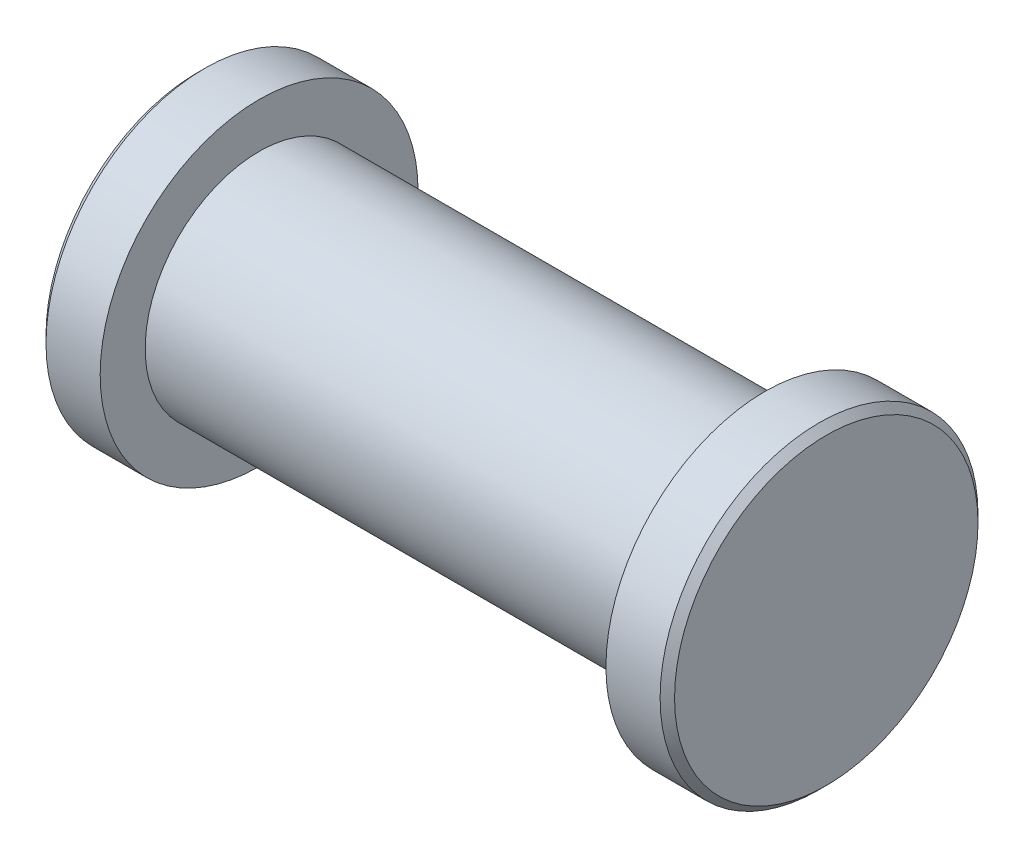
ISO-10303-21;
HEADER;
FILE_DESCRIPTION(('STEP AP214'),'2;1');
FILE_NAME('part.step','',(''),(''),'','','');
FILE_SCHEMA(('AUTOMOTIVE_DESIGN { 1 0 10303 214 1 1 1 1 }'));
ENDSEC;
DATA;
#1=APPLICATION_CONTEXT('core data for automotive mechanical design processes');
#2=APPLICATION_PROTOCOL_DEFINITION('international standard','automotive_design',2000,#1);
#3=PRODUCT_CONTEXT('',#1,'mechanical');
#4=PRODUCT('Part','Part','',(#3));
#5=PRODUCT_RELATED_PRODUCT_CATEGORY('part','',(#4));
#6=PRODUCT_DEFINITION_FORMATION('','',#4);
#7=PRODUCT_DEFINITION_CONTEXT('part definition',#1,'design');
#8=PRODUCT_DEFINITION('design','',#6,#7);
#9=PRODUCT_DEFINITION_SHAPE('','',#8);
#10=(LENGTH_UNIT() NAMED_UNIT(*) SI_UNIT(.MILLI.,.METRE.));
#11=(NAMED_UNIT(*) PLANE_ANGLE_UNIT() SI_UNIT($,.RADIAN.));
#12=(NAMED_UNIT(*) SI_UNIT($,.STERADIAN.) SOLID_ANGLE_UNIT());
#13=UNCERTAINTY_MEASURE_WITH_UNIT(LENGTH_MEASURE(1.E-05),#10,'distance_accuracy_value','');
#14=(GEOMETRIC_REPRESENTATION_CONTEXT(3) GLOBAL_UNCERTAINTY_ASSIGNED_CONTEXT((#13)) GLOBAL_UNIT_ASSIGNED_CONTEXT((#10,
#11,#12)) REPRESENTATION_CONTEXT('',''));
#15=CARTESIAN_POINT('',(0.,0.,0.));
#16=DIRECTION('',(0.,0.,1.));
#17=DIRECTION('',(1.,0.,0.));
#18=AXIS2_PLACEMENT_3D('',#15,#16,#17);
#19=CARTESIAN_POINT('',(299.227077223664,183.252054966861,0.));
#20=DIRECTION('',(-1.,0.,0.));
#21=DIRECTION('',(0.,0.,1.));
#22=AXIS2_PLACEMENT_3D('',#19,#20,#21);
#23=PLANE('',#22);
#24=CARTESIAN_POINT('',(299.227077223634,181.052054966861,0.));
#25=DIRECTION('',(1.,0.,0.));
#26=DIRECTION('',(0.,0.,-1.));
#27=AXIS2_PLACEMENT_3D('',#24,#25,#26);
#28=CIRCLE('',#27,4.19999999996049);
#29=CARTESIAN_POINT('',(299.227077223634,181.052054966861,-4.19999999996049));
#30=VERTEX_POINT('',#29);
#31=EDGE_CURVE('E16',#30,#30,#28,.T.);
#32=ORIENTED_EDGE('',*,*,#31,.F.);
#33=EDGE_LOOP('',(#32));
#34=FACE_BOUND('',#33,.T.);
#35=ADVANCED_FACE('F13',(#34),#23,.T.);
#36=CARTESIAN_POINT('',(316.627077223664,183.252054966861,0.));
#37=DIRECTION('',(1.,0.,0.));
#38=DIRECTION('',(0.,0.,-1.));
#39=AXIS2_PLACEMENT_3D('',#36,#37,#38);
#40=PLANE('',#39);
#41=CARTESIAN_POINT('',(316.627077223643,181.052054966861,0.));
#42=DIRECTION('',(-1.,0.,0.));
#43=DIRECTION('',(0.,0.,1.));
#44=AXIS2_PLACEMENT_3D('',#41,#42,#43);
#45=CIRCLE('',#44,4.20000000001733);
#46=CARTESIAN_POINT('',(316.627077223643,181.052054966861,4.20000000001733));
#47=VERTEX_POINT('',#46);
#48=EDGE_CURVE('E36',#47,#47,#45,.T.);
#49=ORIENTED_EDGE('',*,*,#48,.F.);
#50=EDGE_LOOP('',(#49));
#51=FACE_BOUND('',#50,.T.);
#52=ADVANCED_FACE('F48',(#51),#40,.T.);
#53=CARTESIAN_POINT('',(299.427077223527,181.052054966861,0.));
#54=DIRECTION('',(1.,0.,0.));
#55=DIRECTION('',(0.,0.,-1.));
#56=AXIS2_PLACEMENT_3D('',#53,#54,#55);
#57=CONICAL_SURFACE('',#56,4.39999999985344,0.785398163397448);
#58=ORIENTED_EDGE('',*,*,#31,.T.);
#59=EDGE_LOOP('',(#58));
#60=FACE_BOUND('',#59,.T.);
#61=CARTESIAN_POINT('',(299.427077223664,181.052054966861,0.));
#62=DIRECTION('',(1.,0.,0.));
#63=DIRECTION('',(0.,0.,-1.));
#64=AXIS2_PLACEMENT_3D('',#61,#62,#63);
#65=CIRCLE('',#64,4.40000000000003);
#66=CARTESIAN_POINT('',(299.427077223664,181.052054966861,-4.40000000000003));
#67=VERTEX_POINT('',#66);
#68=EDGE_CURVE('E28',#67,#67,#65,.T.);
#69=ORIENTED_EDGE('',*,*,#68,.F.);
#70=EDGE_LOOP('',(#69));
#71=FACE_BOUND('',#70,.T.);
#72=ADVANCED_FACE('F44',(#60,#71),#57,.T.);
#73=CARTESIAN_POINT('',(316.42707722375,181.052054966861,0.));
#74=DIRECTION('',(-1.,0.,0.));
#75=DIRECTION('',(0.,0.,1.));
#76=AXIS2_PLACEMENT_3D('',#73,#74,#75);
#77=CONICAL_SURFACE('',#76,4.39999999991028,0.785398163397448);
#78=CARTESIAN_POINT('',(316.427077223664,181.052054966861,0.));
#79=DIRECTION('',(1.,0.,0.));
#80=DIRECTION('',(0.,0.,-1.));
#81=AXIS2_PLACEMENT_3D('',#78,#79,#80);
#82=CIRCLE('',#81,4.40000000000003);
#83=CARTESIAN_POINT('',(316.427077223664,181.052054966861,-4.40000000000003));
#84=VERTEX_POINT('',#83);
#85=EDGE_CURVE('E35',#84,#84,#82,.F.);
#86=ORIENTED_EDGE('',*,*,#85,.F.);
#87=EDGE_LOOP('',(#86));
#88=FACE_BOUND('',#87,.T.);
#89=ORIENTED_EDGE('',*,*,#48,.T.);
#90=EDGE_LOOP('',(#89));
#91=FACE_BOUND('',#90,.T.);
#92=ADVANCED_FACE('F76',(#88,#91),#77,.T.);
#93=CARTESIAN_POINT('',(300.077077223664,181.052054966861,0.));
#94=DIRECTION('',(1.,0.,0.));
#95=DIRECTION('',(0.,0.,-1.));
#96=AXIS2_PLACEMENT_3D('',#93,#94,#95);
#97=CYLINDRICAL_SURFACE('',#96,4.40000000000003);
#98=CARTESIAN_POINT('',(300.927077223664,181.052054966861,0.));
#99=DIRECTION('',(1.,0.,0.));
#100=DIRECTION('',(0.,0.,-1.));
#101=AXIS2_PLACEMENT_3D('',#98,#99,#100);
#102=CIRCLE('',#101,4.40000000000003);
#103=CARTESIAN_POINT('',(300.927077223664,181.052054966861,-4.40000000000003));
#104=VERTEX_POINT('',#103);
#105=EDGE_CURVE('E33',#104,#104,#102,.T.);
#106=ORIENTED_EDGE('',*,*,#105,.F.);
#107=EDGE_LOOP('',(#106));
#108=FACE_BOUND('',#107,.T.);
#109=ORIENTED_EDGE('',*,*,#68,.T.);
#110=EDGE_LOOP('',(#109));
#111=FACE_BOUND('',#110,.T.);
#112=ADVANCED_FACE('F72',(#108,#111),#97,.T.);
#113=CARTESIAN_POINT('',(315.777077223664,181.052054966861,0.));
#114=DIRECTION('',(1.,0.,0.));
#115=DIRECTION('',(0.,0.,-1.));
#116=AXIS2_PLACEMENT_3D('',#113,#114,#115);
#117=CYLINDRICAL_SURFACE('',#116,4.40000000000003);
#118=ORIENTED_EDGE('',*,*,#85,.T.);
#119=EDGE_LOOP('',(#118));
#120=FACE_BOUND('',#119,.T.);
#121=CARTESIAN_POINT('',(314.927077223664,181.052054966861,0.));
#122=DIRECTION('',(1.,0.,0.));
#123=DIRECTION('',(0.,0.,-1.));
#124=AXIS2_PLACEMENT_3D('',#121,#122,#123);
#125=CIRCLE('',#124,4.40000000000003);
#126=CARTESIAN_POINT('',(314.927077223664,181.052054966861,-4.40000000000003));
#127=VERTEX_POINT('',#126);
#128=EDGE_CURVE('E25',#127,#127,#125,.F.);
#129=ORIENTED_EDGE('',*,*,#128,.F.);
#130=EDGE_LOOP('',(#129));
#131=FACE_BOUND('',#130,.T.);
#132=ADVANCED_FACE('F68',(#120,#131),#117,.T.);
#133=CARTESIAN_POINT('',(300.927077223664,184.829554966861,0.));
#134=DIRECTION('',(1.,0.,0.));
#135=DIRECTION('',(0.,0.,-1.));
#136=AXIS2_PLACEMENT_3D('',#133,#134,#135);
#137=PLANE('',#136);
#138=ORIENTED_EDGE('',*,*,#105,.T.);
#139=EDGE_LOOP('',(#138));
#140=FACE_BOUND('',#139,.T.);
#141=CARTESIAN_POINT('',(300.927077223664,181.052054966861,0.));
#142=DIRECTION('',(1.,0.,0.));
#143=DIRECTION('',(0.,0.,-1.));
#144=AXIS2_PLACEMENT_3D('',#141,#142,#143);
#145=CIRCLE('',#144,3.15500000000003);
#146=CARTESIAN_POINT('',(300.927077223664,181.052054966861,-3.15500000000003));
#147=VERTEX_POINT('',#146);
#148=EDGE_CURVE('E20',#147,#147,#145,.T.);
#149=ORIENTED_EDGE('',*,*,#148,.F.);
#150=EDGE_LOOP('',(#149));
#151=FACE_BOUND('',#150,.T.);
#152=ADVANCED_FACE('F62',(#140,#151),#137,.T.);
#153=CARTESIAN_POINT('',(314.927077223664,184.829554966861,0.));
#154=DIRECTION('',(-1.,0.,0.));
#155=DIRECTION('',(0.,0.,1.));
#156=AXIS2_PLACEMENT_3D('',#153,#154,#155);
#157=PLANE('',#156);
#158=CARTESIAN_POINT('',(314.927077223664,181.052054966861,0.));
#159=DIRECTION('',(1.,0.,0.));
#160=DIRECTION('',(0.,0.,-1.));
#161=AXIS2_PLACEMENT_3D('',#158,#159,#160);
#162=CIRCLE('',#161,3.15500000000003);
#163=CARTESIAN_POINT('',(314.927077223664,181.052054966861,-3.15500000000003));
#164=VERTEX_POINT('',#163);
#165=EDGE_CURVE('E8',#164,#164,#162,.F.);
#166=ORIENTED_EDGE('',*,*,#165,.F.);
#167=EDGE_LOOP('',(#166));
#168=FACE_BOUND('',#167,.T.);
#169=ORIENTED_EDGE('',*,*,#128,.T.);
#170=EDGE_LOOP('',(#169));
#171=FACE_BOUND('',#170,.T.);
#172=ADVANCED_FACE('F56',(#168,#171),#157,.T.);
#173=CARTESIAN_POINT('',(307.927077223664,181.052054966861,0.));
#174=DIRECTION('',(1.,0.,0.));
#175=DIRECTION('',(0.,0.,-1.));
#176=AXIS2_PLACEMENT_3D('',#173,#174,#175);
#177=CYLINDRICAL_SURFACE('',#176,3.15500000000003);
#178=ORIENTED_EDGE('',*,*,#148,.T.);
#179=EDGE_LOOP('',(#178));
#180=FACE_BOUND('',#179,.T.);
#181=ORIENTED_EDGE('',*,*,#165,.T.);
#182=EDGE_LOOP('',(#181));
#183=FACE_BOUND('',#182,.T.);
#184=ADVANCED_FACE('F54',(#180,#183),#177,.T.);
#185=CLOSED_SHELL('',(#35,#52,#72,#92,#112,#132,#152,#172,#184));
#186=MANIFOLD_SOLID_BREP('B1',#185);
#187=ADVANCED_BREP_SHAPE_REPRESENTATION('',(#18,#186),#14);
#188=SHAPE_DEFINITION_REPRESENTATION(#9,#187);
ENDSEC;
END-ISO-10303-21;
